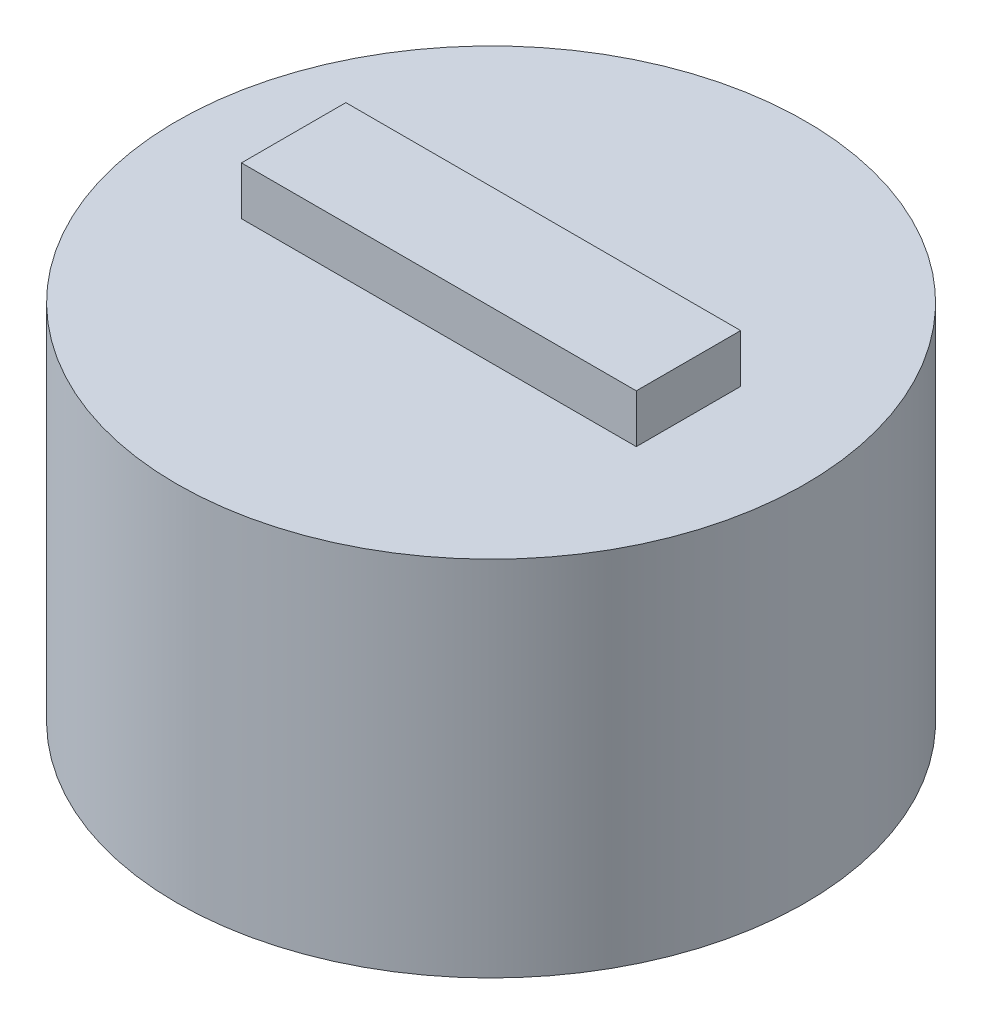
from build123d import *

# Parameters (mm, degrees)
SKETCH1_R           = 65
BOSS_EXTRUDE1_DEPTH = 70
SHELL1_T            = -5
SKETCH2_R           = 25
BOSS_EXTRUDE2_DEPTH = 35
SKETCH3_R           = 65
BOSS_EXTRUDE3_DEPTH = 5
SKETCH4_W           = 81.640791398
SKETCH4_H           = 21.580857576
BOSS_EXTRUDE4_DEPTH = 10


with BuildPart() as part:
    # Sketch1 → Boss-Extrude1 (new body)
    with BuildSketch(Plane(origin=(0, 0, 0), x_dir=(1, 0, 0), z_dir=(0, 1, 0))):
        with Locations(Location((0, 0, 0), (0, 0, 270))):
            Circle(SKETCH1_R)
    extrude(amount=BOSS_EXTRUDE1_DEPTH)

    # Shell1
    shell1_openings = [part.faces().sort_by_distance(p)[0] for p in [
        (0, 70, 0),
    ]]
    offset(amount=SHELL1_T, openings=shell1_openings, kind=Kind.INTERSECTION)

    # Sketch2 → Boss-Extrude2 (add)
    with BuildSketch(Plane(origin=(0, 5, 0), x_dir=(1, 0, 0), z_dir=(0, 1, 0))):
        with Locations(Location((0, 0, 0), (0, 0, 270))):
            Circle(SKETCH2_R)
    extrude(amount=BOSS_EXTRUDE2_DEPTH)

    # Sketch3 → Boss-Extrude3 (add)
    with BuildSketch(Plane(origin=(0, 70, 0), x_dir=(1, 0, 0), z_dir=(0, 1, 0))):
        with Locations(Location((0, 0, 0), (0, 0, 270))):
            Circle(SKETCH3_R)
    extrude(amount=BOSS_EXTRUDE3_DEPTH)

    # Sketch4 → Boss-Extrude4 (add)
    with BuildSketch(Plane(origin=(0, 75, 0), x_dir=(1, 0, 0), z_dir=(0, 1, 0))):
        Rectangle(SKETCH4_W, SKETCH4_H)
    extrude(amount=BOSS_EXTRUDE4_DEPTH)


solid = part.part
